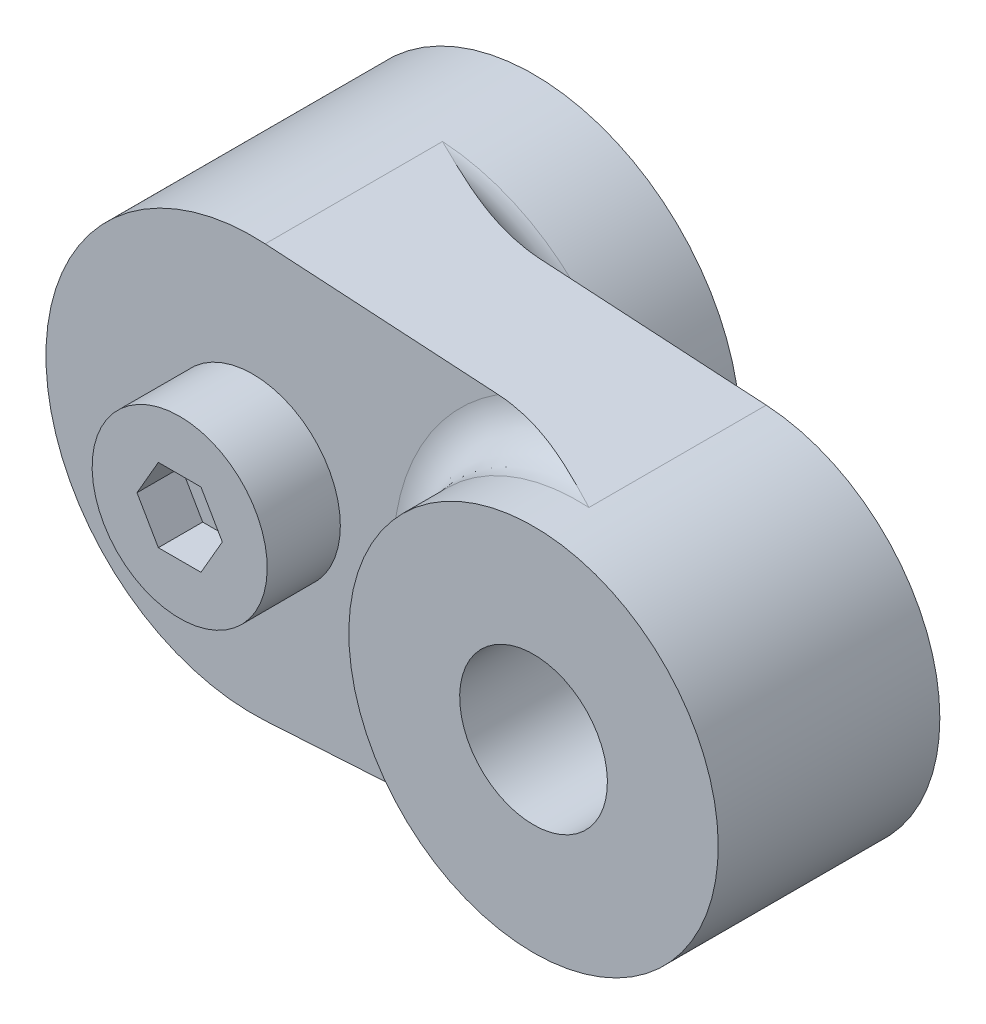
ISO-10303-21;
HEADER;
FILE_DESCRIPTION(('STEP AP214'),'2;1');
FILE_NAME('part.step','',(''),(''),'','','');
FILE_SCHEMA(('AUTOMOTIVE_DESIGN { 1 0 10303 214 1 1 1 1 }'));
ENDSEC;
DATA;
#1=APPLICATION_CONTEXT('core data for automotive mechanical design processes');
#2=APPLICATION_PROTOCOL_DEFINITION('international standard','automotive_design',2000,#1);
#3=PRODUCT_CONTEXT('',#1,'mechanical');
#4=PRODUCT('Part','Part','',(#3));
#5=PRODUCT_RELATED_PRODUCT_CATEGORY('part','',(#4));
#6=PRODUCT_DEFINITION_FORMATION('','',#4);
#7=PRODUCT_DEFINITION_CONTEXT('part definition',#1,'design');
#8=PRODUCT_DEFINITION('design','',#6,#7);
#9=PRODUCT_DEFINITION_SHAPE('','',#8);
#10=(LENGTH_UNIT() NAMED_UNIT(*) SI_UNIT(.MILLI.,.METRE.));
#11=(NAMED_UNIT(*) PLANE_ANGLE_UNIT() SI_UNIT($,.RADIAN.));
#12=(NAMED_UNIT(*) SI_UNIT($,.STERADIAN.) SOLID_ANGLE_UNIT());
#13=UNCERTAINTY_MEASURE_WITH_UNIT(LENGTH_MEASURE(1.E-05),#10,'distance_accuracy_value','');
#14=(GEOMETRIC_REPRESENTATION_CONTEXT(3) GLOBAL_UNCERTAINTY_ASSIGNED_CONTEXT((#13)) GLOBAL_UNIT_ASSIGNED_CONTEXT((#10,
#11,#12)) REPRESENTATION_CONTEXT('',''));
#15=CARTESIAN_POINT('',(0.,0.,0.));
#16=DIRECTION('',(0.,0.,1.));
#17=DIRECTION('',(1.,0.,0.));
#18=AXIS2_PLACEMENT_3D('',#15,#16,#17);
#19=CARTESIAN_POINT('',(25.75,-12.4774797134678,25.));
#20=DIRECTION('',(0.06,-0.998198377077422,0.));
#21=DIRECTION('',(0.998198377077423,0.06,0.));
#22=AXIS2_PLACEMENT_3D('',#19,#20,#21);
#23=PLANE('',#22);
#24=DIRECTION('',(0.,0.,-1.));
#25=VECTOR('',#24,1.);
#26=CARTESIAN_POINT('',(0.84,-13.9747772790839,25.));
#27=LINE('',#26,#25);
#28=CARTESIAN_POINT('',(0.84,-13.9747772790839,19.));
#29=VERTEX_POINT('',#28);
#30=CARTESIAN_POINT('',(0.84,-13.9747772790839,7.));
#31=VERTEX_POINT('',#30);
#32=EDGE_CURVE('E195',#29,#31,#27,.T.);
#33=ORIENTED_EDGE('',*,*,#32,.T.);
#34=CARTESIAN_POINT('',(10.4662765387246,-13.3961582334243,10.));
#35=CARTESIAN_POINT('',(10.2901574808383,-13.4067444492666,9.99997897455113));
#36=CARTESIAN_POINT('',(10.1140935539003,-13.4173273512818,9.99499251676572));
#37=CARTESIAN_POINT('',(9.76254126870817,-13.4384585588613,9.97605534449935));
#38=CARTESIAN_POINT('',(9.58705263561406,-13.4490068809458,9.96210983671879));
#39=CARTESIAN_POINT('',(9.23741470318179,-13.4700230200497,9.92627055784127));
#40=CARTESIAN_POINT('',(9.06326300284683,-13.4804909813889,9.90439977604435));
#41=CARTESIAN_POINT('',(8.71598721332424,-13.5013651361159,9.85351916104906));
#42=CARTESIAN_POINT('',(8.5428632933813,-13.5117713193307,9.82450818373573));
#43=CARTESIAN_POINT('',(8.02934239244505,-13.5426381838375,9.7286557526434));
#44=CARTESIAN_POINT('',(7.69065497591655,-13.5629961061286,9.65253290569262));
#45=CARTESIAN_POINT('',(7.01823457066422,-13.6034141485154,9.48023699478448));
#46=CARTESIAN_POINT('',(6.68450601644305,-13.6234740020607,9.38404702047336));
#47=CARTESIAN_POINT('',(5.8813279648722,-13.671751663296,9.13151508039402));
#48=CARTESIAN_POINT('',(5.4144622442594,-13.6998141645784,8.96698070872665));
#49=CARTESIAN_POINT('',(4.48940947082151,-13.7554175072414,8.61551577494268));
#50=CARTESIAN_POINT('',(4.03122240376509,-13.7829583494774,8.4285852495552));
#51=CARTESIAN_POINT('',(2.66290255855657,-13.8652057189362,7.84532166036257));
#52=CARTESIAN_POINT('',(1.76202665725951,-13.9193558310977,7.42758543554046));
#53=CARTESIAN_POINT('',(0.85429087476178,-13.973918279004,7.00662731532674));
#54=CARTESIAN_POINT('',(0.847145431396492,-13.9743477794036,7.00331364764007));
#55=CARTESIAN_POINT('',(0.84,-13.9747772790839,7.));
#56=B_SPLINE_CURVE_WITH_KNOTS('',3,(#34,#35,#36,#37,#38,#39,#40,#41,#42,#43,#44,#45,#46,#47,#48,
#49,#50,#51,#52,#53,#54,#55),.UNSPECIFIED.,.F.,.F.,(4,2,2,2,2,2,2,2,2,2,4),(0.,
0.529161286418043,1.05801531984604,1.58534739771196,2.1127640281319,3.15510729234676,
4.19833250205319,5.68482585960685,7.17131677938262,10.1538893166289,10.1775536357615),.UNSPECIFIED.);
#57=CARTESIAN_POINT('',(10.4662765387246,-13.3961582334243,10.));
#58=VERTEX_POINT('',#57);
#59=EDGE_CURVE('E37',#31,#58,#56,.F.);
#60=ORIENTED_EDGE('',*,*,#59,.T.);
#61=DIRECTION('',(-0.998198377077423,-0.06,0.));
#62=VECTOR('',#61,1.);
#63=CARTESIAN_POINT('',(25.75,-12.4774797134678,10.));
#64=LINE('',#63,#62);
#65=CARTESIAN_POINT('',(25.75,-12.4774797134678,10.));
#66=VERTEX_POINT('',#65);
#67=EDGE_CURVE('E167',#66,#58,#64,.T.);
#68=ORIENTED_EDGE('',*,*,#67,.F.);
#69=DIRECTION('',(0.,0.,-1.));
#70=VECTOR('',#69,1.);
#71=CARTESIAN_POINT('',(25.75,-12.4774797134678,25.));
#72=LINE('',#71,#70);
#73=CARTESIAN_POINT('',(25.75,-12.4774797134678,22.));
#74=VERTEX_POINT('',#73);
#75=EDGE_CURVE('E192',#74,#66,#72,.T.);
#76=ORIENTED_EDGE('',*,*,#75,.F.);
#77=CARTESIAN_POINT('',(16.6013607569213,-13.0273887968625,19.));
#78=CARTESIAN_POINT('',(16.7645065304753,-13.0175823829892,19.0000163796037));
#79=CARTESIAN_POINT('',(16.9276028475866,-13.0077789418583,19.0046687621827));
#80=CARTESIAN_POINT('',(17.2532529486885,-12.9882046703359,19.0223867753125));
#81=CARTESIAN_POINT('',(17.4158069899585,-12.9784338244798,19.0354475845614));
#82=CARTESIAN_POINT('',(17.739642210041,-12.9589686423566,19.0690764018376));
#83=CARTESIAN_POINT('',(17.900925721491,-12.9492741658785,19.0896223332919));
#84=CARTESIAN_POINT('',(18.2225001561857,-12.9299448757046,19.1374908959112));
#85=CARTESIAN_POINT('',(18.3827909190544,-12.9203100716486,19.164814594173));
#86=CARTESIAN_POINT('',(18.8578431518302,-12.8917554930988,19.2551475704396));
#87=CARTESIAN_POINT('',(19.1709492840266,-12.8729352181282,19.326988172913));
#88=CARTESIAN_POINT('',(19.7922779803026,-12.8355882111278,19.4899355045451));
#89=CARTESIAN_POINT('',(20.1004961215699,-12.8170617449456,19.5810587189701));
#90=CARTESIAN_POINT('',(20.8658664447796,-12.7710566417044,19.8284891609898));
#91=CARTESIAN_POINT('',(21.3198697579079,-12.7437672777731,19.9945156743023));
#92=CARTESIAN_POINT('',(22.2181612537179,-12.6897725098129,20.3506648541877));
#93=CARTESIAN_POINT('',(22.6624485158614,-12.6630671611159,20.5407897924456));
#94=CARTESIAN_POINT('',(23.9882324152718,-12.5833765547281,21.1353894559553));
#95=CARTESIAN_POINT('',(24.8592612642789,-12.5310204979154,21.5628415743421));
#96=CARTESIAN_POINT('',(25.7366371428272,-12.4782829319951,21.9934417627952));
#97=CARTESIAN_POINT('',(25.74331857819,-12.4778813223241,21.996720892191));
#98=CARTESIAN_POINT('',(25.75,-12.4774797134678,22.));
#99=B_SPLINE_CURVE_WITH_KNOTS('',3,(#77,#78,#79,#80,#81,#82,#83,#84,#85,#86,#87,#88,#89,#90,#91,
#92,#93,#94,#95,#96,#97,#98),.UNSPECIFIED.,.F.,.F.,(4,2,2,2,2,2,2,2,2,2,4),(0.,
0.490183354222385,0.980085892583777,1.46855506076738,1.95710118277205,2.92163302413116,
3.88699282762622,5.33841179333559,6.78996768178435,9.70390170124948,9.72626238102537),.UNSPECIFIED.);
#100=CARTESIAN_POINT('',(16.6013607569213,-13.0273887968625,19.));
#101=VERTEX_POINT('',#100);
#102=EDGE_CURVE('E207',#74,#101,#99,.F.);
#103=ORIENTED_EDGE('',*,*,#102,.T.);
#104=DIRECTION('',(0.998198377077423,0.06,0.));
#105=VECTOR('',#104,1.);
#106=CARTESIAN_POINT('',(0.84,-13.9747772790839,19.));
#107=LINE('',#106,#105);
#108=EDGE_CURVE('E175',#29,#101,#107,.T.);
#109=ORIENTED_EDGE('',*,*,#108,.F.);
#110=EDGE_LOOP('',(#33,#60,#68,#76,#103,#109));
#111=FACE_BOUND('',#110,.T.);
#112=ADVANCED_FACE('F14',(#111),#23,.T.);
#113=CARTESIAN_POINT('',(25.75,12.4774797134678,25.));
#114=DIRECTION('',(-0.06,-0.998198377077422,0.));
#115=DIRECTION('',(0.998198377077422,-0.06,0.));
#116=AXIS2_PLACEMENT_3D('',#113,#114,#115);
#117=PLANE('',#116);
#118=DIRECTION('',(0.998198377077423,-0.06,0.));
#119=VECTOR('',#118,1.);
#120=CARTESIAN_POINT('',(0.84,13.9747772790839,10.));
#121=LINE('',#120,#119);
#122=CARTESIAN_POINT('',(10.4662765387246,13.3961582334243,10.));
#123=VERTEX_POINT('',#122);
#124=CARTESIAN_POINT('',(25.75,12.4774797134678,10.));
#125=VERTEX_POINT('',#124);
#126=EDGE_CURVE('E171',#123,#125,#121,.T.);
#127=ORIENTED_EDGE('',*,*,#126,.F.);
#128=CARTESIAN_POINT('',(10.4662765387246,13.3961582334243,10.));
#129=CARTESIAN_POINT('',(10.2901574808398,13.4067444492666,9.99997897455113));
#130=CARTESIAN_POINT('',(10.1140935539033,13.4173273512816,9.99499251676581));
#131=CARTESIAN_POINT('',(9.76254126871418,13.4384585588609,9.97605534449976));
#132=CARTESIAN_POINT('',(9.58705263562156,13.4490068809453,9.96210983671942));
#133=CARTESIAN_POINT('',(9.23741470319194,13.4700230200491,9.92627055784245));
#134=CARTESIAN_POINT('',(9.06326300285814,13.4804909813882,9.90439977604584));
#135=CARTESIAN_POINT('',(8.71598721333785,13.5013651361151,9.85351916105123));
#136=CARTESIAN_POINT('',(8.54286329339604,13.5117713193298,9.82450818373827));
#137=CARTESIAN_POINT('',(8.02934239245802,13.5426381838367,9.72865575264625));
#138=CARTESIAN_POINT('',(7.69065497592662,13.5629961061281,9.65253290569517));
#139=CARTESIAN_POINT('',(7.01823457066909,13.6034141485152,9.48023699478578));
#140=CARTESIAN_POINT('',(6.68450601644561,13.6234740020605,9.38404702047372));
#141=CARTESIAN_POINT('',(5.88132796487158,13.6717516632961,9.13151508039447));
#142=CARTESIAN_POINT('',(5.41446224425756,13.6998141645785,8.96698070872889));
#143=CARTESIAN_POINT('',(4.48940947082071,13.7554175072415,8.61551577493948));
#144=CARTESIAN_POINT('',(4.03122240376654,13.7829583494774,8.42858524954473));
#145=CARTESIAN_POINT('',(2.66290255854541,13.8652057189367,7.84532166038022));
#146=CARTESIAN_POINT('',(1.76202665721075,13.9193558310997,7.42758543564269));
#147=CARTESIAN_POINT('',(0.85429087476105,13.973918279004,7.00662731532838));
#148=CARTESIAN_POINT('',(0.847145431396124,13.9743477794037,7.0033136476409));
#149=CARTESIAN_POINT('',(0.84,13.9747772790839,7.));
#150=B_SPLINE_CURVE_WITH_KNOTS('',3,(#128,#129,#130,#131,#132,#133,#134,#135,#136,#137,#138,
#139,#140,#141,#142,#143,#144,#145,#146,#147,#148,#149),.UNSPECIFIED.,.F.,.F.,(4,2,2,2,2,2,2,2,
2,2,4),(0.,0.529161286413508,1.05801531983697,1.58534739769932,2.11276402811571,
3.15510729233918,4.1983325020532,5.68482585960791,7.17131677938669,10.1538893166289,
10.1775536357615),.UNSPECIFIED.);
#151=CARTESIAN_POINT('',(0.84,13.9747772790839,7.));
#152=VERTEX_POINT('',#151);
#153=EDGE_CURVE('E22',#123,#152,#150,.T.);
#154=ORIENTED_EDGE('',*,*,#153,.T.);
#155=DIRECTION('',(0.,0.,-1.));
#156=VECTOR('',#155,1.);
#157=CARTESIAN_POINT('',(0.84,13.9747772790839,25.));
#158=LINE('',#157,#156);
#159=CARTESIAN_POINT('',(0.84,13.9747772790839,19.));
#160=VERTEX_POINT('',#159);
#161=EDGE_CURVE('E186',#160,#152,#158,.T.);
#162=ORIENTED_EDGE('',*,*,#161,.F.);
#163=DIRECTION('',(-0.998198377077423,0.06,0.));
#164=VECTOR('',#163,1.);
#165=CARTESIAN_POINT('',(25.75,12.4774797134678,19.));
#166=LINE('',#165,#164);
#167=CARTESIAN_POINT('',(16.6013607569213,13.0273887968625,19.));
#168=VERTEX_POINT('',#167);
#169=EDGE_CURVE('E178',#168,#160,#166,.T.);
#170=ORIENTED_EDGE('',*,*,#169,.F.);
#171=CARTESIAN_POINT('',(16.6013607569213,13.0273887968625,19.));
#172=CARTESIAN_POINT('',(16.7645065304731,13.0175823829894,19.0000163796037));
#173=CARTESIAN_POINT('',(16.9276028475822,13.0077789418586,19.0046687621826));
#174=CARTESIAN_POINT('',(17.2532529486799,12.9882046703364,19.0223867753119));
#175=CARTESIAN_POINT('',(17.4158069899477,12.9784338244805,19.0354475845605));
#176=CARTESIAN_POINT('',(17.7396422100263,12.9589686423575,19.0690764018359));
#177=CARTESIAN_POINT('',(17.9009257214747,12.9492741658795,19.0896223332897));
#178=CARTESIAN_POINT('',(18.2225001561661,12.9299448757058,19.137490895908));
#179=CARTESIAN_POINT('',(18.3827909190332,12.9203100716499,19.1648145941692));
#180=CARTESIAN_POINT('',(18.8578431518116,12.8917554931,19.2551475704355));
#181=CARTESIAN_POINT('',(19.1709492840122,12.8729352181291,19.3269881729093));
#182=CARTESIAN_POINT('',(19.7922779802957,12.8355882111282,19.4899355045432));
#183=CARTESIAN_POINT('',(20.1004961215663,12.8170617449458,19.5810587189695));
#184=CARTESIAN_POINT('',(20.8658664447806,12.7710566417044,19.8284891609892));
#185=CARTESIAN_POINT('',(21.3198697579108,12.743767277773,19.9945156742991));
#186=CARTESIAN_POINT('',(22.2181612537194,12.6897725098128,20.3506648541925));
#187=CARTESIAN_POINT('',(22.6624485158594,12.6630671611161,20.5407897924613));
#188=CARTESIAN_POINT('',(23.9882324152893,12.583376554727,21.1353894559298));
#189=CARTESIAN_POINT('',(24.8592612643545,12.5310204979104,21.5628415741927));
#190=CARTESIAN_POINT('',(25.7366371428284,12.478282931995,21.9934417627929));
#191=CARTESIAN_POINT('',(25.7433185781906,12.4778813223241,21.9967208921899));
#192=CARTESIAN_POINT('',(25.75,12.4774797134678,22.));
#193=B_SPLINE_CURVE_WITH_KNOTS('',3,(#171,#172,#173,#174,#175,#176,#177,#178,#179,#180,#181,
#182,#183,#184,#185,#186,#187,#188,#189,#190,#191,#192),.UNSPECIFIED.,.F.,.F.,(4,2,2,2,2,2,2,2,
2,2,4),(0.,0.490183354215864,0.98008589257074,1.46855506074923,1.9571011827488,2.92163302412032,
3.88699282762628,5.33841179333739,6.78996768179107,9.70390170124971,9.72626238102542),.UNSPECIFIED.);
#194=CARTESIAN_POINT('',(25.75,12.4774797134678,22.));
#195=VERTEX_POINT('',#194);
#196=EDGE_CURVE('E214',#168,#195,#193,.T.);
#197=ORIENTED_EDGE('',*,*,#196,.T.);
#198=DIRECTION('',(0.,0.,-1.));
#199=VECTOR('',#198,1.);
#200=CARTESIAN_POINT('',(25.75,12.4774797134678,25.));
#201=LINE('',#200,#199);
#202=EDGE_CURVE('E189',#195,#125,#201,.T.);
#203=ORIENTED_EDGE('',*,*,#202,.T.);
#204=EDGE_LOOP('',(#127,#154,#162,#170,#197,#203));
#205=FACE_BOUND('',#204,.T.);
#206=ADVANCED_FACE('F251',(#205),#117,.F.);
#207=CARTESIAN_POINT('',(25.,0.,25.));
#208=DIRECTION('',(0.,0.,-1.));
#209=DIRECTION('',(0.,1.,0.));
#210=AXIS2_PLACEMENT_3D('',#207,#208,#209);
#211=CYLINDRICAL_SURFACE('',#210,12.5);
#212=CARTESIAN_POINT('',(25.,0.,25.));
#213=DIRECTION('',(0.,0.,1.));
#214=DIRECTION('',(0.,-1.,0.));
#215=AXIS2_PLACEMENT_3D('',#212,#213,#214);
#216=CIRCLE('',#215,12.5);
#217=CARTESIAN_POINT('',(25.,-12.5,25.));
#218=VERTEX_POINT('',#217);
#219=EDGE_CURVE('E183',#218,#218,#216,.T.);
#220=ORIENTED_EDGE('',*,*,#219,.F.);
#221=EDGE_LOOP('',(#220));
#222=FACE_BOUND('',#221,.T.);
#223=CARTESIAN_POINT('',(25.,0.,22.));
#224=DIRECTION('',(0.,0.,1.));
#225=DIRECTION('',(0.,-1.,0.));
#226=AXIS2_PLACEMENT_3D('',#223,#224,#225);
#227=CIRCLE('',#226,12.5);
#228=EDGE_CURVE('E197',#195,#74,#227,.T.);
#229=ORIENTED_EDGE('',*,*,#228,.T.);
#230=ORIENTED_EDGE('',*,*,#75,.T.);
#231=CARTESIAN_POINT('',(25.,0.,10.));
#232=DIRECTION('',(0.,0.,-1.));
#233=DIRECTION('',(0.,1.,0.));
#234=AXIS2_PLACEMENT_3D('',#231,#232,#233);
#235=CIRCLE('',#234,12.5);
#236=EDGE_CURVE('E169',#125,#66,#235,.T.);
#237=ORIENTED_EDGE('',*,*,#236,.F.);
#238=ORIENTED_EDGE('',*,*,#202,.F.);
#239=EDGE_LOOP('',(#229,#230,#237,#238));
#240=FACE_BOUND('',#239,.T.);
#241=ADVANCED_FACE('F244',(#222,#240),#211,.T.);
#242=CARTESIAN_POINT('',(0.,0.,0.));
#243=DIRECTION('',(0.,0.,1.));
#244=DIRECTION('',(0.,-1.,0.));
#245=AXIS2_PLACEMENT_3D('',#242,#243,#244);
#246=PLANE('',#245);
#247=CARTESIAN_POINT('',(0.,0.,0.));
#248=DIRECTION('',(0.,0.,1.));
#249=DIRECTION('',(0.,-1.,0.));
#250=AXIS2_PLACEMENT_3D('',#247,#248,#249);
#251=CIRCLE('',#250,14.);
#252=CARTESIAN_POINT('',(0.,-14.,0.));
#253=VERTEX_POINT('',#252);
#254=EDGE_CURVE('E180',#253,#253,#251,.T.);
#255=ORIENTED_EDGE('',*,*,#254,.F.);
#256=EDGE_LOOP('',(#255));
#257=FACE_BOUND('',#256,.T.);
#258=ADVANCED_FACE('F240',(#257),#246,.F.);
#259=CARTESIAN_POINT('',(0.,0.,25.));
#260=DIRECTION('',(0.,0.,-1.));
#261=DIRECTION('',(0.,1.,0.));
#262=AXIS2_PLACEMENT_3D('',#259,#260,#261);
#263=CYLINDRICAL_SURFACE('',#262,14.);
#264=ORIENTED_EDGE('',*,*,#254,.T.);
#265=EDGE_LOOP('',(#264));
#266=FACE_BOUND('',#265,.T.);
#267=CARTESIAN_POINT('',(0.,0.,7.));
#268=DIRECTION('',(0.,0.,-1.));
#269=DIRECTION('',(0.,1.,0.));
#270=AXIS2_PLACEMENT_3D('',#267,#268,#269);
#271=CIRCLE('',#270,14.);
#272=EDGE_CURVE('E202',#152,#31,#271,.T.);
#273=ORIENTED_EDGE('',*,*,#272,.T.);
#274=ORIENTED_EDGE('',*,*,#32,.F.);
#275=CARTESIAN_POINT('',(0.,0.,19.));
#276=DIRECTION('',(0.,0.,1.));
#277=DIRECTION('',(0.,-1.,0.));
#278=AXIS2_PLACEMENT_3D('',#275,#276,#277);
#279=CIRCLE('',#278,14.);
#280=EDGE_CURVE('E173',#160,#29,#279,.T.);
#281=ORIENTED_EDGE('',*,*,#280,.F.);
#282=ORIENTED_EDGE('',*,*,#161,.T.);
#283=EDGE_LOOP('',(#273,#274,#281,#282));
#284=FACE_BOUND('',#283,.T.);
#285=ADVANCED_FACE('F243',(#266,#284),#263,.T.);
#286=CARTESIAN_POINT('',(0.,0.,25.));
#287=DIRECTION('',(0.,0.,1.));
#288=DIRECTION('',(0.,-1.,0.));
#289=AXIS2_PLACEMENT_3D('',#286,#287,#288);
#290=PLANE('',#289);
#291=CARTESIAN_POINT('',(25.,0.,25.));
#292=DIRECTION('',(0.,0.,1.));
#293=DIRECTION('',(0.,-1.,0.));
#294=AXIS2_PLACEMENT_3D('',#291,#292,#293);
#295=CIRCLE('',#294,5.);
#296=CARTESIAN_POINT('',(25.,-5.,25.));
#297=VERTEX_POINT('',#296);
#298=EDGE_CURVE('E163',#297,#297,#295,.T.);
#299=ORIENTED_EDGE('',*,*,#298,.F.);
#300=EDGE_LOOP('',(#299));
#301=FACE_BOUND('',#300,.T.);
#302=ORIENTED_EDGE('',*,*,#219,.T.);
#303=EDGE_LOOP('',(#302));
#304=FACE_BOUND('',#303,.T.);
#305=ADVANCED_FACE('F238',(#301,#304),#290,.T.);
#306=CARTESIAN_POINT('',(0.,0.,19.));
#307=DIRECTION('',(0.,0.,1.));
#308=DIRECTION('',(0.,-1.,0.));
#309=AXIS2_PLACEMENT_3D('',#306,#307,#308);
#310=PLANE('',#309);
#311=CARTESIAN_POINT('',(0.,0.,19.));
#312=DIRECTION('',(0.,0.,1.));
#313=DIRECTION('',(0.,-1.,0.));
#314=AXIS2_PLACEMENT_3D('',#311,#312,#313);
#315=CIRCLE('',#314,5.925);
#316=CARTESIAN_POINT('',(0.,-5.925,19.));
#317=VERTEX_POINT('',#316);
#318=EDGE_CURVE('E9',#317,#317,#315,.T.);
#319=ORIENTED_EDGE('',*,*,#318,.F.);
#320=EDGE_LOOP('',(#319));
#321=FACE_BOUND('',#320,.T.);
#322=ORIENTED_EDGE('',*,*,#108,.T.);
#323=CARTESIAN_POINT('',(25.,0.,19.));
#324=DIRECTION('',(0.,0.,1.));
#325=DIRECTION('',(0.,-1.,0.));
#326=AXIS2_PLACEMENT_3D('',#323,#324,#325);
#327=CIRCLE('',#326,15.5);
#328=EDGE_CURVE('E200',#101,#168,#327,.F.);
#329=ORIENTED_EDGE('',*,*,#328,.T.);
#330=ORIENTED_EDGE('',*,*,#169,.T.);
#331=ORIENTED_EDGE('',*,*,#280,.T.);
#332=EDGE_LOOP('',(#322,#329,#330,#331));
#333=FACE_BOUND('',#332,.T.);
#334=ADVANCED_FACE('F234',(#321,#333),#310,.T.);
#335=CARTESIAN_POINT('',(0.,0.,10.));
#336=DIRECTION('',(0.,0.,-1.));
#337=DIRECTION('',(0.,1.,0.));
#338=AXIS2_PLACEMENT_3D('',#335,#336,#337);
#339=PLANE('',#338);
#340=CARTESIAN_POINT('',(25.,0.,10.));
#341=DIRECTION('',(0.,0.,-1.));
#342=DIRECTION('',(0.,1.,0.));
#343=AXIS2_PLACEMENT_3D('',#340,#341,#342);
#344=CIRCLE('',#343,5.);
#345=CARTESIAN_POINT('',(25.,5.,10.));
#346=VERTEX_POINT('',#345);
#347=EDGE_CURVE('E166',#346,#346,#344,.T.);
#348=ORIENTED_EDGE('',*,*,#347,.F.);
#349=EDGE_LOOP('',(#348));
#350=FACE_BOUND('',#349,.T.);
#351=ORIENTED_EDGE('',*,*,#67,.T.);
#352=CARTESIAN_POINT('',(0.,0.,10.));
#353=DIRECTION('',(0.,0.,-1.));
#354=DIRECTION('',(0.,1.,0.));
#355=AXIS2_PLACEMENT_3D('',#352,#353,#354);
#356=CIRCLE('',#355,17.);
#357=EDGE_CURVE('E205',#58,#123,#356,.F.);
#358=ORIENTED_EDGE('',*,*,#357,.T.);
#359=ORIENTED_EDGE('',*,*,#126,.T.);
#360=ORIENTED_EDGE('',*,*,#236,.T.);
#361=EDGE_LOOP('',(#351,#358,#359,#360));
#362=FACE_BOUND('',#361,.T.);
#363=ADVANCED_FACE('F227',(#350,#362),#339,.T.);
#364=CARTESIAN_POINT('',(25.,0.,22.));
#365=DIRECTION('',(0.,0.,1.));
#366=DIRECTION('',(0.,-1.,0.));
#367=AXIS2_PLACEMENT_3D('',#364,#365,#366);
#368=TOROIDAL_SURFACE('',#367,15.5,3.);
#369=ORIENTED_EDGE('',*,*,#196,.F.);
#370=ORIENTED_EDGE('',*,*,#328,.F.);
#371=ORIENTED_EDGE('',*,*,#102,.F.);
#372=ORIENTED_EDGE('',*,*,#228,.F.);
#373=EDGE_LOOP('',(#369,#370,#371,#372));
#374=FACE_BOUND('',#373,.T.);
#375=ADVANCED_FACE('F221',(#374),#368,.F.);
#376=CARTESIAN_POINT('',(0.,0.,7.));
#377=DIRECTION('',(0.,0.,-1.));
#378=DIRECTION('',(0.,1.,0.));
#379=AXIS2_PLACEMENT_3D('',#376,#377,#378);
#380=TOROIDAL_SURFACE('',#379,17.,3.);
#381=ORIENTED_EDGE('',*,*,#153,.F.);
#382=ORIENTED_EDGE('',*,*,#357,.F.);
#383=ORIENTED_EDGE('',*,*,#59,.F.);
#384=ORIENTED_EDGE('',*,*,#272,.F.);
#385=EDGE_LOOP('',(#381,#382,#383,#384));
#386=FACE_BOUND('',#385,.T.);
#387=ADVANCED_FACE('F226',(#386),#380,.F.);
#388=CARTESIAN_POINT('',(25.,0.,0.));
#389=DIRECTION('',(0.,0.,1.));
#390=DIRECTION('',(0.,-1.,0.));
#391=AXIS2_PLACEMENT_3D('',#388,#389,#390);
#392=CYLINDRICAL_SURFACE('',#391,5.);
#393=ORIENTED_EDGE('',*,*,#347,.T.);
#394=EDGE_LOOP('',(#393));
#395=FACE_BOUND('',#394,.T.);
#396=ORIENTED_EDGE('',*,*,#298,.T.);
#397=EDGE_LOOP('',(#396));
#398=FACE_BOUND('',#397,.T.);
#399=ADVANCED_FACE('F268',(#395,#398),#392,.F.);
#400=CARTESIAN_POINT('',(0.,0.,23.95));
#401=DIRECTION('',(0.,0.,-1.));
#402=DIRECTION('',(0.,1.,0.));
#403=AXIS2_PLACEMENT_3D('',#400,#401,#402);
#404=CYLINDRICAL_SURFACE('',#403,5.925);
#405=CARTESIAN_POINT('',(0.,0.,23.95));
#406=DIRECTION('',(0.,0.,-1.));
#407=DIRECTION('',(0.,1.,0.));
#408=AXIS2_PLACEMENT_3D('',#405,#406,#407);
#409=CIRCLE('',#408,5.925);
#410=CARTESIAN_POINT('',(0.,5.925,23.95));
#411=VERTEX_POINT('',#410);
#412=EDGE_CURVE('E160',#411,#411,#409,.T.);
#413=ORIENTED_EDGE('',*,*,#412,.T.);
#414=EDGE_LOOP('',(#413));
#415=FACE_BOUND('',#414,.T.);
#416=ORIENTED_EDGE('',*,*,#318,.T.);
#417=EDGE_LOOP('',(#416));
#418=FACE_BOUND('',#417,.T.);
#419=ADVANCED_FACE('F353',(#415,#418),#404,.T.);
#420=CARTESIAN_POINT('',(0.,0.,23.95));
#421=DIRECTION('',(0.,0.,-1.));
#422=DIRECTION('',(0.,1.,0.));
#423=AXIS2_PLACEMENT_3D('',#420,#421,#422);
#424=PLANE('',#423);
#425=DIRECTION('',(-0.5,0.866025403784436,0.));
#426=VECTOR('',#425,1.);
#427=CARTESIAN_POINT('',(-1.44337567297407,-2.5,23.95));
#428=LINE('',#427,#426);
#429=CARTESIAN_POINT('',(-1.44337567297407,-2.5,23.95));
#430=VERTEX_POINT('',#429);
#431=CARTESIAN_POINT('',(-2.88675134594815,0.,23.95));
#432=VERTEX_POINT('',#431);
#433=EDGE_CURVE('E119',#430,#432,#428,.T.);
#434=ORIENTED_EDGE('',*,*,#433,.T.);
#435=DIRECTION('',(-0.500000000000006,-0.866025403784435,0.));
#436=VECTOR('',#435,1.);
#437=CARTESIAN_POINT('',(-1.44337567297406,2.5,23.95));
#438=LINE('',#437,#436);
#439=CARTESIAN_POINT('',(-1.44337567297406,2.5,23.95));
#440=VERTEX_POINT('',#439);
#441=EDGE_CURVE('E29',#440,#432,#438,.T.);
#442=ORIENTED_EDGE('',*,*,#441,.F.);
#443=DIRECTION('',(-1.,0.,0.));
#444=VECTOR('',#443,1.);
#445=CARTESIAN_POINT('',(1.44337567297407,2.5,23.95));
#446=LINE('',#445,#444);
#447=CARTESIAN_POINT('',(1.44337567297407,2.5,23.95));
#448=VERTEX_POINT('',#447);
#449=EDGE_CURVE('E134',#448,#440,#446,.T.);
#450=ORIENTED_EDGE('',*,*,#449,.F.);
#451=DIRECTION('',(0.5,-0.866025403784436,0.));
#452=VECTOR('',#451,1.);
#453=CARTESIAN_POINT('',(1.44337567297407,2.5,23.95));
#454=LINE('',#453,#452);
#455=CARTESIAN_POINT('',(2.88675134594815,0.,23.95));
#456=VERTEX_POINT('',#455);
#457=EDGE_CURVE('E129',#448,#456,#454,.T.);
#458=ORIENTED_EDGE('',*,*,#457,.T.);
#459=DIRECTION('',(0.5,0.866025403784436,0.));
#460=VECTOR('',#459,1.);
#461=CARTESIAN_POINT('',(1.44337567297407,-2.5,23.95));
#462=LINE('',#461,#460);
#463=CARTESIAN_POINT('',(1.44337567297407,-2.5,23.95));
#464=VERTEX_POINT('',#463);
#465=EDGE_CURVE('E127',#464,#456,#462,.T.);
#466=ORIENTED_EDGE('',*,*,#465,.F.);
#467=DIRECTION('',(-1.,0.,0.));
#468=VECTOR('',#467,1.);
#469=CARTESIAN_POINT('',(1.44337567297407,-2.5,23.95));
#470=LINE('',#469,#468);
#471=EDGE_CURVE('E108',#464,#430,#470,.T.);
#472=ORIENTED_EDGE('',*,*,#471,.T.);
#473=EDGE_LOOP('',(#434,#442,#450,#458,#466,#472));
#474=FACE_BOUND('',#473,.T.);
#475=ORIENTED_EDGE('',*,*,#412,.F.);
#476=EDGE_LOOP('',(#475));
#477=FACE_BOUND('',#476,.T.);
#478=ADVANCED_FACE('F123',(#474,#477),#424,.F.);
#479=CARTESIAN_POINT('',(-1.44337567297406,2.5,20.95));
#480=DIRECTION('',(-0.866025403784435,0.500000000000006,0.));
#481=DIRECTION('',(-0.500000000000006,-0.866025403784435,0.));
#482=AXIS2_PLACEMENT_3D('',#479,#480,#481);
#483=PLANE('',#482);
#484=DIRECTION('',(0.,0.,1.));
#485=VECTOR('',#484,1.);
#486=CARTESIAN_POINT('',(-1.44337567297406,2.5,20.95));
#487=LINE('',#486,#485);
#488=CARTESIAN_POINT('',(-1.44337567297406,2.5,20.95));
#489=VERTEX_POINT('',#488);
#490=EDGE_CURVE('E158',#489,#440,#487,.T.);
#491=ORIENTED_EDGE('',*,*,#490,.T.);
#492=ORIENTED_EDGE('',*,*,#441,.T.);
#493=DIRECTION('',(0.,0.,1.));
#494=VECTOR('',#493,1.);
#495=CARTESIAN_POINT('',(-2.88675134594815,0.,20.95));
#496=LINE('',#495,#494);
#497=CARTESIAN_POINT('',(-2.88675134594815,0.,20.95));
#498=VERTEX_POINT('',#497);
#499=EDGE_CURVE('E116',#498,#432,#496,.T.);
#500=ORIENTED_EDGE('',*,*,#499,.F.);
#501=DIRECTION('',(-0.500000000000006,-0.866025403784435,0.));
#502=VECTOR('',#501,1.);
#503=CARTESIAN_POINT('',(-1.44337567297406,2.5,20.95));
#504=LINE('',#503,#502);
#505=EDGE_CURVE('E137',#489,#498,#504,.T.);
#506=ORIENTED_EDGE('',*,*,#505,.F.);
#507=EDGE_LOOP('',(#491,#492,#500,#506));
#508=FACE_BOUND('',#507,.T.);
#509=ADVANCED_FACE('F361',(#508),#483,.F.);
#510=CARTESIAN_POINT('',(1.44337567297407,2.5,20.95));
#511=DIRECTION('',(0.,1.,0.));
#512=DIRECTION('',(-1.,0.,0.));
#513=AXIS2_PLACEMENT_3D('',#510,#511,#512);
#514=PLANE('',#513);
#515=DIRECTION('',(0.,0.,1.));
#516=VECTOR('',#515,1.);
#517=CARTESIAN_POINT('',(1.44337567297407,2.5,20.95));
#518=LINE('',#517,#516);
#519=CARTESIAN_POINT('',(1.44337567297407,2.5,20.95));
#520=VERTEX_POINT('',#519);
#521=EDGE_CURVE('E156',#520,#448,#518,.T.);
#522=ORIENTED_EDGE('',*,*,#521,.T.);
#523=ORIENTED_EDGE('',*,*,#449,.T.);
#524=ORIENTED_EDGE('',*,*,#490,.F.);
#525=DIRECTION('',(-1.,0.,0.));
#526=VECTOR('',#525,1.);
#527=CARTESIAN_POINT('',(1.44337567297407,2.5,20.95));
#528=LINE('',#527,#526);
#529=EDGE_CURVE('E149',#520,#489,#528,.T.);
#530=ORIENTED_EDGE('',*,*,#529,.F.);
#531=EDGE_LOOP('',(#522,#523,#524,#530));
#532=FACE_BOUND('',#531,.T.);
#533=ADVANCED_FACE('F373',(#532),#514,.F.);
#534=CARTESIAN_POINT('',(1.44337567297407,2.5,20.95));
#535=DIRECTION('',(-0.866025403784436,-0.5,0.));
#536=DIRECTION('',(0.5,-0.866025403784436,0.));
#537=AXIS2_PLACEMENT_3D('',#534,#535,#536);
#538=PLANE('',#537);
#539=DIRECTION('',(0.,0.,1.));
#540=VECTOR('',#539,1.);
#541=CARTESIAN_POINT('',(2.88675134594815,0.,20.95));
#542=LINE('',#541,#540);
#543=CARTESIAN_POINT('',(2.88675134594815,0.,20.95));
#544=VERTEX_POINT('',#543);
#545=EDGE_CURVE('E154',#544,#456,#542,.T.);
#546=ORIENTED_EDGE('',*,*,#545,.T.);
#547=ORIENTED_EDGE('',*,*,#457,.F.);
#548=ORIENTED_EDGE('',*,*,#521,.F.);
#549=DIRECTION('',(0.5,-0.866025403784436,0.));
#550=VECTOR('',#549,1.);
#551=CARTESIAN_POINT('',(1.44337567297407,2.5,20.95));
#552=LINE('',#551,#550);
#553=EDGE_CURVE('E146',#520,#544,#552,.T.);
#554=ORIENTED_EDGE('',*,*,#553,.T.);
#555=EDGE_LOOP('',(#546,#547,#548,#554));
#556=FACE_BOUND('',#555,.T.);
#557=ADVANCED_FACE('F380',(#556),#538,.T.);
#558=CARTESIAN_POINT('',(1.44337567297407,-2.5,20.95));
#559=DIRECTION('',(0.866025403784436,-0.5,0.));
#560=DIRECTION('',(0.5,0.866025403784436,0.));
#561=AXIS2_PLACEMENT_3D('',#558,#559,#560);
#562=PLANE('',#561);
#563=DIRECTION('',(0.,0.,1.));
#564=VECTOR('',#563,1.);
#565=CARTESIAN_POINT('',(1.44337567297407,-2.5,20.95));
#566=LINE('',#565,#564);
#567=CARTESIAN_POINT('',(1.44337567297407,-2.5,20.95));
#568=VERTEX_POINT('',#567);
#569=EDGE_CURVE('E115',#568,#464,#566,.T.);
#570=ORIENTED_EDGE('',*,*,#569,.T.);
#571=ORIENTED_EDGE('',*,*,#465,.T.);
#572=ORIENTED_EDGE('',*,*,#545,.F.);
#573=DIRECTION('',(0.5,0.866025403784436,0.));
#574=VECTOR('',#573,1.);
#575=CARTESIAN_POINT('',(1.44337567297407,-2.5,20.95));
#576=LINE('',#575,#574);
#577=EDGE_CURVE('E143',#568,#544,#576,.T.);
#578=ORIENTED_EDGE('',*,*,#577,.F.);
#579=EDGE_LOOP('',(#570,#571,#572,#578));
#580=FACE_BOUND('',#579,.T.);
#581=ADVANCED_FACE('F388',(#580),#562,.F.);
#582=CARTESIAN_POINT('',(1.44337567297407,-2.5,20.95));
#583=DIRECTION('',(0.,1.,0.));
#584=DIRECTION('',(0.,0.,1.));
#585=AXIS2_PLACEMENT_3D('',#582,#583,#584);
#586=PLANE('',#585);
#587=DIRECTION('',(0.,0.,1.));
#588=VECTOR('',#587,1.);
#589=CARTESIAN_POINT('',(-1.44337567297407,-2.5,20.95));
#590=LINE('',#589,#588);
#591=CARTESIAN_POINT('',(-1.44337567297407,-2.5,20.95));
#592=VERTEX_POINT('',#591);
#593=EDGE_CURVE('E104',#592,#430,#590,.T.);
#594=ORIENTED_EDGE('',*,*,#593,.T.);
#595=ORIENTED_EDGE('',*,*,#471,.F.);
#596=ORIENTED_EDGE('',*,*,#569,.F.);
#597=DIRECTION('',(-1.,0.,0.));
#598=VECTOR('',#597,1.);
#599=CARTESIAN_POINT('',(1.44337567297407,-2.5,20.95));
#600=LINE('',#599,#598);
#601=EDGE_CURVE('E111',#568,#592,#600,.T.);
#602=ORIENTED_EDGE('',*,*,#601,.T.);
#603=EDGE_LOOP('',(#594,#595,#596,#602));
#604=FACE_BOUND('',#603,.T.);
#605=ADVANCED_FACE('F106',(#604),#586,.T.);
#606=CARTESIAN_POINT('',(-1.44337567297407,-2.5,20.95));
#607=DIRECTION('',(0.866025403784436,0.5,0.));
#608=DIRECTION('',(-0.5,0.866025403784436,0.));
#609=AXIS2_PLACEMENT_3D('',#606,#607,#608);
#610=PLANE('',#609);
#611=DIRECTION('',(-0.5,0.866025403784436,0.));
#612=VECTOR('',#611,1.);
#613=CARTESIAN_POINT('',(-1.44337567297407,-2.5,20.95));
#614=LINE('',#613,#612);
#615=EDGE_CURVE('E140',#592,#498,#614,.T.);
#616=ORIENTED_EDGE('',*,*,#615,.T.);
#617=ORIENTED_EDGE('',*,*,#499,.T.);
#618=ORIENTED_EDGE('',*,*,#433,.F.);
#619=ORIENTED_EDGE('',*,*,#593,.F.);
#620=EDGE_LOOP('',(#616,#617,#618,#619));
#621=FACE_BOUND('',#620,.T.);
#622=ADVANCED_FACE('F120',(#621),#610,.T.);
#623=CARTESIAN_POINT('',(0.,5.,20.95));
#624=DIRECTION('',(0.,0.,1.));
#625=DIRECTION('',(0.,-1.,0.));
#626=AXIS2_PLACEMENT_3D('',#623,#624,#625);
#627=PLANE('',#626);
#628=ORIENTED_EDGE('',*,*,#505,.T.);
#629=ORIENTED_EDGE('',*,*,#615,.F.);
#630=ORIENTED_EDGE('',*,*,#601,.F.);
#631=ORIENTED_EDGE('',*,*,#577,.T.);
#632=ORIENTED_EDGE('',*,*,#553,.F.);
#633=ORIENTED_EDGE('',*,*,#529,.T.);
#634=EDGE_LOOP('',(#628,#629,#630,#631,#632,#633));
#635=FACE_BOUND('',#634,.T.);
#636=ADVANCED_FACE('F404',(#635),#627,.T.);
#637=CLOSED_SHELL('',(#112,#206,#241,#258,#285,#305,#334,#363,#375,#387,#399,#419,#478,#509,
#533,#557,#581,#605,#622,#636));
#638=MANIFOLD_SOLID_BREP('B1',#637);
#639=ADVANCED_BREP_SHAPE_REPRESENTATION('',(#18,#638),#14);
#640=SHAPE_DEFINITION_REPRESENTATION(#9,#639);
ENDSEC;
END-ISO-10303-21;
